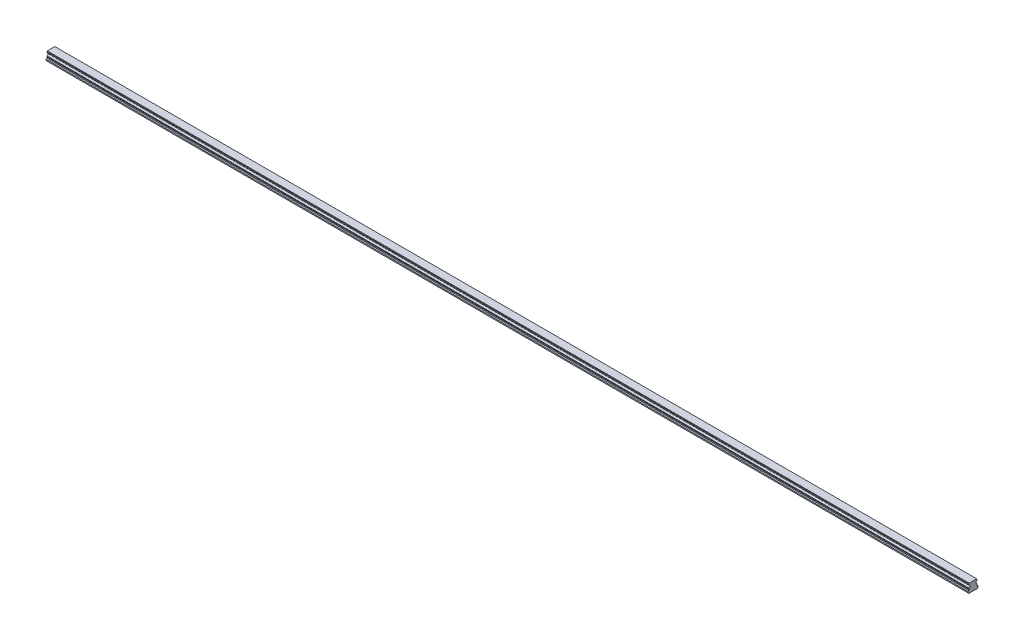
from build123d import *

# Parameters (mm, degrees)
BOSS_EXTRUDE1_DEPTH        = 2280
SKETCH3_R                  = 3
SKETCH3_R_2                = 2.5
CUT_EXTRUDE3_DEPTH         = 12
SKETCH3_2_R                = 2.5
CUT_EXTRUDE4_DEPTH         = 15
CHAMFER1_SIZE              = 0.5
LPATTERN4_COUNT            = 38
LPATTERN4_PITCH            = 60
CHAMFER1_OF_LPATTERN4_SIZE = 0.5


with BuildPart() as part:
    # Sketch1 → Boss-Extrude1 (new body)
    with BuildSketch(Plane(origin=(0, 0, 0), x_dir=(0, 0, -1), z_dir=(1, 0, 0))):
        with BuildLine():
            Line((9.375, 21.8), (-9.375, 21.8))
            Line((-9.375, 21.8), (-9.375, 20.756))
            Line((-9.375, 20.756), (-10, 19.415683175))
            Line((-10, 19.415683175), (-10, 17.685449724))
            ThreePointArc((-10, 17.685449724), (-7.2, 14.6), (-10, 11.514550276))
            Line((-10, 11.514550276), (-10, 9.784316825))
            Line((-10, 9.784316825), (-9.375, 8.444))
            Line((-9.375, 8.444), (-9.922688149, 6.4))
            Line((-9.922688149, 6.4), (-12.5, 5.489338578))
            Line((-12.5, 5.489338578), (-12.5, 2.65))
            Line((-12.5, 2.65), (-9.85, 0))
            Line((-9.85, 0), (-5.5, 0))
            Line((-5.5, 0), (-5, 0.5))
            Line((-5, 0.5), (5, 0.5))
            Line((5, 0.5), (5.5, 0))
            Line((5.5, 0), (9.85, 0))
            Line((9.85, 0), (12.5, 2.65))
            Line((12.5, 2.65), (12.5, 5.489338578))
            Line((12.5, 5.489338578), (9.922688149, 6.4))
            Line((9.922688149, 6.4), (9.375, 8.444))
            Line((9.375, 8.444), (10, 9.784316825))
            Line((10, 9.784316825), (10, 11.514550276))
            ThreePointArc((10, 11.514550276), (7.2, 14.6), (10, 17.685449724))
            Line((10, 17.685449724), (10, 19.415683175))
            Line((10, 19.415683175), (9.375, 20.756))
            Line((9.375, 20.756), (9.375, 21.8))
        make_face()
    extrude(amount=BOSS_EXTRUDE1_DEPTH)

    # Sketch3 → Cut-Extrude3 (cut)
    with BuildSketch(Plane.XZ):
        with Locations(Location((30, 0, 0), (0, 0, 270))):
            Circle(SKETCH3_R)
        with Locations(Location((30, 0, 0), (0, 0, 270))):
            Circle(SKETCH3_R_2, mode=Mode.SUBTRACT)
    cut_extrude3 = extrude(amount=-CUT_EXTRUDE3_DEPTH, mode=Mode.SUBTRACT)

    # Sketch3_2 → Cut-Extrude4 (cut)
    with BuildSketch(Plane.XZ):
        with Locations(Location((30, 0, 0), (0, 0, 270))):
            Circle(SKETCH3_2_R)
    cut_extrude4 = extrude(amount=-CUT_EXTRUDE4_DEPTH, mode=Mode.SUBTRACT)

    # Cut-Extrude5 cone 1 section (on through the dimple's axis) → Cut-Extrude5 (revolve, cut)
    with BuildSketch(Plane(origin=(30, 15, 0), x_dir=(0, 0, -1), z_dir=(1, 0, 0))):
        Polygon((0, 0), (2.5, 0), (0, 1.443375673), align=None)
    cut_extrude5 = revolve(axis=Axis((30, 15, 0), (0, 1, 0)), mode=Mode.SUBTRACT)

    # Chamfer1
    chamfer1_edges = [part.edges().sort_by_distance(p)[0] for p in [
        (30, 0.5, 3),
    ]]
    chamfer(chamfer1_edges, length=CHAMFER1_SIZE)

    # LPattern4: Cut-Extrude3, Cut-Extrude4, Cut-Extrude5 ×38
    with Locations(*[(i * LPATTERN4_PITCH, 0, 0) for i in range(1, LPATTERN4_COUNT)]):
        add(cut_extrude3, mode=Mode.SUBTRACT)
        add(cut_extrude4, mode=Mode.SUBTRACT)
        add(cut_extrude5, mode=Mode.SUBTRACT)

    # Chamfer1 of LPattern4
    chamfer1_of_lpattern4_edges = [part.edges().sort_by_distance(p)[0] for p in [
        (90, 0.5, 3),
        (150, 0.5, 3),
        (210, 0.5, 3),
        (270, 0.5, 3),
        (330, 0.5, 3),
        (390, 0.5, 3),
        (450, 0.5, 3),
        (510, 0.5, 3),
        (570, 0.5, 3),
        (630, 0.5, 3),
        (690, 0.5, 3),
        (750, 0.5, 3),
        (810, 0.5, 3),
        (870, 0.5, 3),
        (930, 0.5, 3),
        (990, 0.5, 3),
        (1050, 0.5, 3),
        (1110, 0.5, 3),
        (1170, 0.5, 3),
        (1230, 0.5, 3),
        (1290, 0.5, 3),
        (1350, 0.5, 3),
        (1410, 0.5, 3),
        (1470, 0.5, 3),
        (1530, 0.5, 3),
        (1590, 0.5, 3),
        (1650, 0.5, 3),
        (1710, 0.5, 3),
        (1770, 0.5, 3),
        (1830, 0.5, 3),
        (1890, 0.5, 3),
        (1950, 0.5, 3),
        (2010, 0.5, 3),
        (2070, 0.5, 3),
        (2130, 0.5, 3),
        (2190, 0.5, 3),
        (2250, 0.5, 3),
    ]]
    chamfer(chamfer1_of_lpattern4_edges, length=CHAMFER1_OF_LPATTERN4_SIZE)


solid = part.part
